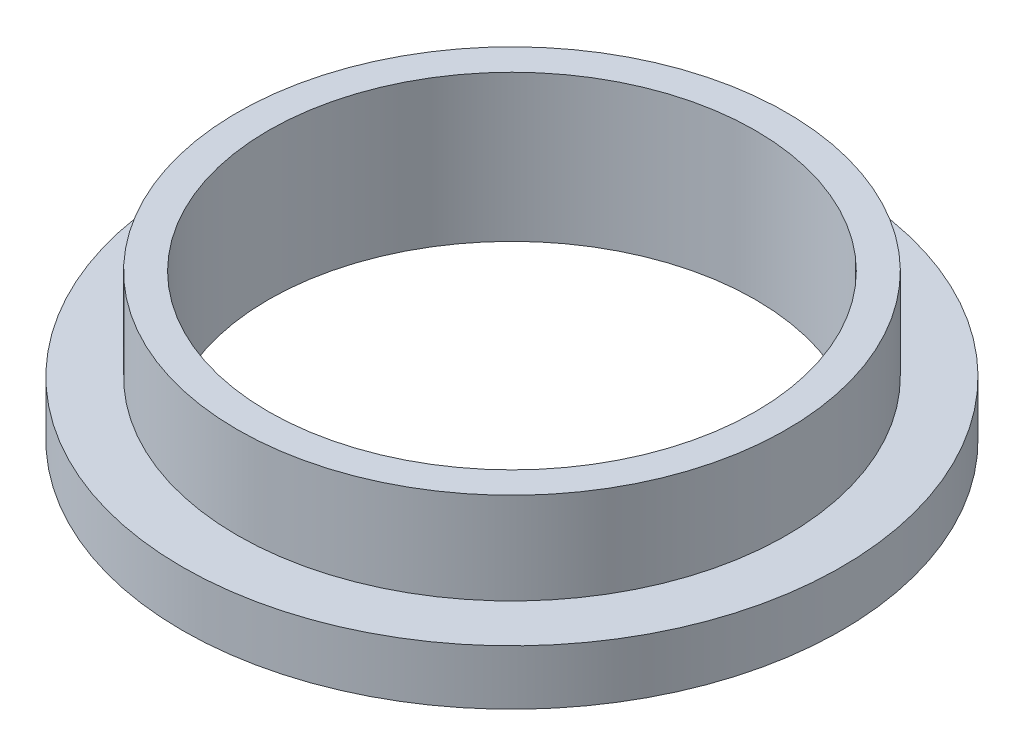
ISO-10303-21;
HEADER;
FILE_DESCRIPTION(('STEP AP214'),'2;1');
FILE_NAME('part.step','',(''),(''),'','','');
FILE_SCHEMA(('AUTOMOTIVE_DESIGN { 1 0 10303 214 1 1 1 1 }'));
ENDSEC;
DATA;
#1=APPLICATION_CONTEXT('core data for automotive mechanical design processes');
#2=APPLICATION_PROTOCOL_DEFINITION('international standard','automotive_design',2000,#1);
#3=PRODUCT_CONTEXT('',#1,'mechanical');
#4=PRODUCT('Part','Part','',(#3));
#5=PRODUCT_RELATED_PRODUCT_CATEGORY('part','',(#4));
#6=PRODUCT_DEFINITION_FORMATION('','',#4);
#7=PRODUCT_DEFINITION_CONTEXT('part definition',#1,'design');
#8=PRODUCT_DEFINITION('design','',#6,#7);
#9=PRODUCT_DEFINITION_SHAPE('','',#8);
#10=(LENGTH_UNIT() NAMED_UNIT(*) SI_UNIT(.MILLI.,.METRE.));
#11=(NAMED_UNIT(*) PLANE_ANGLE_UNIT() SI_UNIT($,.RADIAN.));
#12=(NAMED_UNIT(*) SI_UNIT($,.STERADIAN.) SOLID_ANGLE_UNIT());
#13=UNCERTAINTY_MEASURE_WITH_UNIT(LENGTH_MEASURE(1.E-05),#10,'distance_accuracy_value','');
#14=(GEOMETRIC_REPRESENTATION_CONTEXT(3) GLOBAL_UNCERTAINTY_ASSIGNED_CONTEXT((#13)) GLOBAL_UNIT_ASSIGNED_CONTEXT((#10,
#11,#12)) REPRESENTATION_CONTEXT('',''));
#15=CARTESIAN_POINT('',(0.,0.,0.));
#16=DIRECTION('',(0.,0.,1.));
#17=DIRECTION('',(1.,0.,0.));
#18=AXIS2_PLACEMENT_3D('',#15,#16,#17);
#19=CARTESIAN_POINT('',(0.,8.,0.));
#20=DIRECTION('',(0.,-1.,0.));
#21=DIRECTION('',(0.,0.,-1.));
#22=AXIS2_PLACEMENT_3D('',#19,#20,#21);
#23=CYLINDRICAL_SURFACE('',#22,7.5);
#24=CARTESIAN_POINT('',(0.,1.5,0.));
#25=DIRECTION('',(0.,1.,0.));
#26=DIRECTION('',(0.,0.,1.));
#27=AXIS2_PLACEMENT_3D('',#24,#25,#26);
#28=CIRCLE('',#27,7.5);
#29=CARTESIAN_POINT('',(0.,1.5,7.5));
#30=VERTEX_POINT('',#29);
#31=EDGE_CURVE('E47',#30,#30,#28,.T.);
#32=ORIENTED_EDGE('',*,*,#31,.T.);
#33=EDGE_LOOP('',(#32));
#34=FACE_BOUND('',#33,.T.);
#35=CARTESIAN_POINT('',(0.,4.,0.));
#36=DIRECTION('',(0.,1.,0.));
#37=DIRECTION('',(0.,0.,1.));
#38=AXIS2_PLACEMENT_3D('',#35,#36,#37);
#39=CIRCLE('',#38,7.5);
#40=CARTESIAN_POINT('',(0.,4.,7.5));
#41=VERTEX_POINT('',#40);
#42=EDGE_CURVE('E53',#41,#41,#39,.T.);
#43=ORIENTED_EDGE('',*,*,#42,.F.);
#44=EDGE_LOOP('',(#43));
#45=FACE_BOUND('',#44,.T.);
#46=ADVANCED_FACE('F35',(#34,#45),#23,.T.);
#47=CARTESIAN_POINT('',(0.,-2.,0.));
#48=DIRECTION('',(0.,1.,0.));
#49=DIRECTION('',(0.,0.,1.));
#50=AXIS2_PLACEMENT_3D('',#47,#48,#49);
#51=CYLINDRICAL_SURFACE('',#50,6.65);
#52=CARTESIAN_POINT('',(0.,0.,0.));
#53=DIRECTION('',(0.,1.,0.));
#54=DIRECTION('',(0.,0.,1.));
#55=AXIS2_PLACEMENT_3D('',#52,#53,#54);
#56=CIRCLE('',#55,6.65);
#57=CARTESIAN_POINT('',(0.,0.,6.65));
#58=VERTEX_POINT('',#57);
#59=EDGE_CURVE('E51',#58,#58,#56,.T.);
#60=ORIENTED_EDGE('',*,*,#59,.F.);
#61=EDGE_LOOP('',(#60));
#62=FACE_BOUND('',#61,.T.);
#63=CARTESIAN_POINT('',(0.,4.,0.));
#64=DIRECTION('',(0.,1.,0.));
#65=DIRECTION('',(0.,0.,1.));
#66=AXIS2_PLACEMENT_3D('',#63,#64,#65);
#67=CIRCLE('',#66,6.65);
#68=CARTESIAN_POINT('',(0.,4.,6.65));
#69=VERTEX_POINT('',#68);
#70=EDGE_CURVE('E38',#69,#69,#67,.F.);
#71=ORIENTED_EDGE('',*,*,#70,.F.);
#72=EDGE_LOOP('',(#71));
#73=FACE_BOUND('',#72,.T.);
#74=ADVANCED_FACE('F65',(#62,#73),#51,.F.);
#75=CARTESIAN_POINT('',(0.,0.,0.));
#76=DIRECTION('',(0.,1.,0.));
#77=DIRECTION('',(0.,0.,1.));
#78=AXIS2_PLACEMENT_3D('',#75,#76,#77);
#79=PLANE('',#78);
#80=ORIENTED_EDGE('',*,*,#59,.T.);
#81=EDGE_LOOP('',(#80));
#82=FACE_BOUND('',#81,.T.);
#83=CARTESIAN_POINT('',(0.,0.,0.));
#84=DIRECTION('',(0.,1.,0.));
#85=DIRECTION('',(0.,0.,1.));
#86=AXIS2_PLACEMENT_3D('',#83,#84,#85);
#87=CIRCLE('',#86,9.);
#88=CARTESIAN_POINT('',(0.,0.,9.));
#89=VERTEX_POINT('',#88);
#90=EDGE_CURVE('E42',#89,#89,#87,.T.);
#91=ORIENTED_EDGE('',*,*,#90,.F.);
#92=EDGE_LOOP('',(#91));
#93=FACE_BOUND('',#92,.T.);
#94=ADVANCED_FACE('F67',(#82,#93),#79,.F.);
#95=CARTESIAN_POINT('',(0.,1.5,0.));
#96=DIRECTION('',(0.,1.,0.));
#97=DIRECTION('',(0.,0.,1.));
#98=AXIS2_PLACEMENT_3D('',#95,#96,#97);
#99=PLANE('',#98);
#100=CARTESIAN_POINT('',(0.,1.5,0.));
#101=DIRECTION('',(0.,1.,0.));
#102=DIRECTION('',(0.,0.,1.));
#103=AXIS2_PLACEMENT_3D('',#100,#101,#102);
#104=CIRCLE('',#103,9.);
#105=CARTESIAN_POINT('',(0.,1.5,9.));
#106=VERTEX_POINT('',#105);
#107=EDGE_CURVE('E10',#106,#106,#104,.T.);
#108=ORIENTED_EDGE('',*,*,#107,.T.);
#109=EDGE_LOOP('',(#108));
#110=FACE_BOUND('',#109,.T.);
#111=ORIENTED_EDGE('',*,*,#31,.F.);
#112=EDGE_LOOP('',(#111));
#113=FACE_BOUND('',#112,.T.);
#114=ADVANCED_FACE('F74',(#110,#113),#99,.T.);
#115=CARTESIAN_POINT('',(0.,1.5,0.));
#116=DIRECTION('',(0.,-1.,0.));
#117=DIRECTION('',(0.,0.,-1.));
#118=AXIS2_PLACEMENT_3D('',#115,#116,#117);
#119=CYLINDRICAL_SURFACE('',#118,9.);
#120=ORIENTED_EDGE('',*,*,#107,.F.);
#121=EDGE_LOOP('',(#120));
#122=FACE_BOUND('',#121,.T.);
#123=ORIENTED_EDGE('',*,*,#90,.T.);
#124=EDGE_LOOP('',(#123));
#125=FACE_BOUND('',#124,.T.);
#126=ADVANCED_FACE('F80',(#122,#125),#119,.T.);
#127=CARTESIAN_POINT('',(0.,4.,0.));
#128=DIRECTION('',(0.,1.,0.));
#129=DIRECTION('',(0.,0.,1.));
#130=AXIS2_PLACEMENT_3D('',#127,#128,#129);
#131=PLANE('',#130);
#132=ORIENTED_EDGE('',*,*,#70,.T.);
#133=EDGE_LOOP('',(#132));
#134=FACE_BOUND('',#133,.T.);
#135=ORIENTED_EDGE('',*,*,#42,.T.);
#136=EDGE_LOOP('',(#135));
#137=FACE_BOUND('',#136,.T.);
#138=ADVANCED_FACE('F63',(#134,#137),#131,.T.);
#139=CLOSED_SHELL('',(#46,#74,#94,#114,#126,#138));
#140=MANIFOLD_SOLID_BREP('B2',#139);
#141=ADVANCED_BREP_SHAPE_REPRESENTATION('',(#18,#140),#14);
#142=SHAPE_DEFINITION_REPRESENTATION(#9,#141);
ENDSEC;
END-ISO-10303-21;
